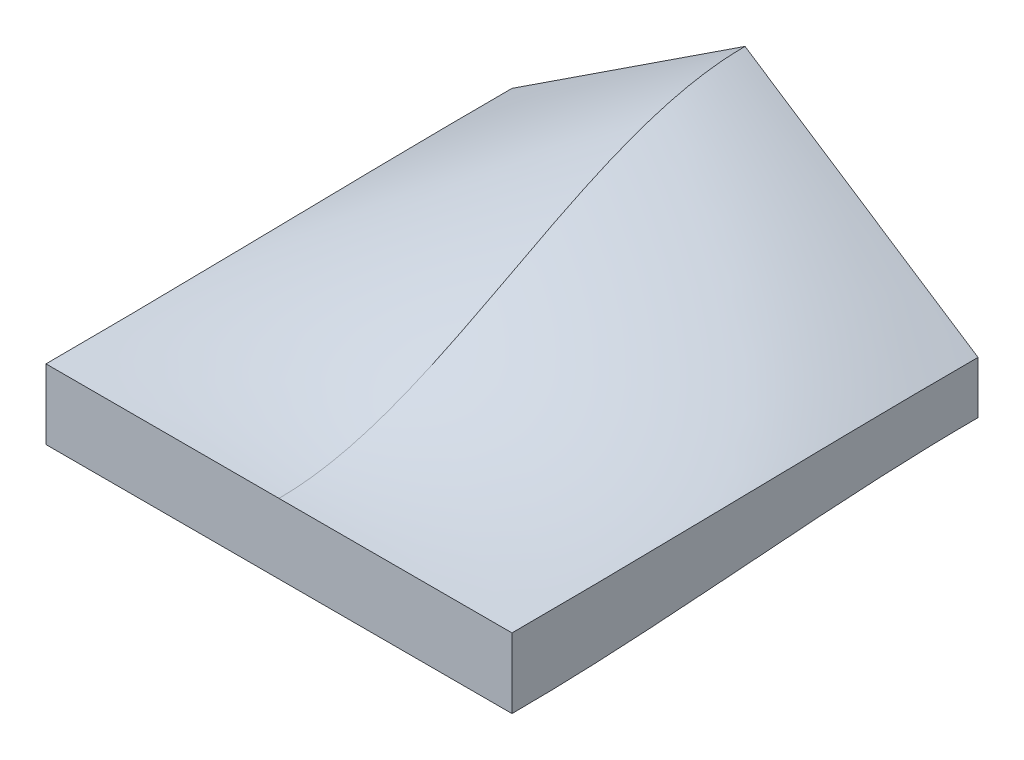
ISO-10303-21;
HEADER;
FILE_DESCRIPTION(('STEP AP214'),'2;1');
FILE_NAME('part.step','',(''),(''),'','','');
FILE_SCHEMA(('AUTOMOTIVE_DESIGN { 1 0 10303 214 1 1 1 1 }'));
ENDSEC;
DATA;
#1=APPLICATION_CONTEXT('core data for automotive mechanical design processes');
#2=APPLICATION_PROTOCOL_DEFINITION('international standard','automotive_design',2000,#1);
#3=PRODUCT_CONTEXT('',#1,'mechanical');
#4=PRODUCT('Part','Part','',(#3));
#5=PRODUCT_RELATED_PRODUCT_CATEGORY('part','',(#4));
#6=PRODUCT_DEFINITION_FORMATION('','',#4);
#7=PRODUCT_DEFINITION_CONTEXT('part definition',#1,'design');
#8=PRODUCT_DEFINITION('design','',#6,#7);
#9=PRODUCT_DEFINITION_SHAPE('','',#8);
#10=(LENGTH_UNIT() NAMED_UNIT(*) SI_UNIT(.MILLI.,.METRE.));
#11=(NAMED_UNIT(*) PLANE_ANGLE_UNIT() SI_UNIT($,.RADIAN.));
#12=(NAMED_UNIT(*) SI_UNIT($,.STERADIAN.) SOLID_ANGLE_UNIT());
#13=UNCERTAINTY_MEASURE_WITH_UNIT(LENGTH_MEASURE(1.E-05),#10,'distance_accuracy_value','');
#14=(GEOMETRIC_REPRESENTATION_CONTEXT(3) GLOBAL_UNCERTAINTY_ASSIGNED_CONTEXT((#13)) GLOBAL_UNIT_ASSIGNED_CONTEXT((#10,
#11,#12)) REPRESENTATION_CONTEXT('',''));
#15=CARTESIAN_POINT('',(0.,0.,0.));
#16=DIRECTION('',(0.,0.,1.));
#17=DIRECTION('',(1.,0.,0.));
#18=AXIS2_PLACEMENT_3D('',#15,#16,#17);
#19=CARTESIAN_POINT('',(0.,0.,-50.));
#20=DIRECTION('',(0.,0.,1.));
#21=DIRECTION('',(1.,0.,0.));
#22=AXIS2_PLACEMENT_3D('',#19,#20,#21);
#23=PLANE('',#22);
#24=DIRECTION('',(0.,-1.,0.));
#25=VECTOR('',#24,1.);
#26=CARTESIAN_POINT('',(-25.,0.6,-50.));
#27=LINE('',#26,#25);
#28=CARTESIAN_POINT('',(-25.,0.6,-50.));
#29=VERTEX_POINT('',#28);
#30=CARTESIAN_POINT('',(-25.,-5.,-50.));
#31=VERTEX_POINT('',#30);
#32=EDGE_CURVE('E177',#29,#31,#27,.T.);
#33=ORIENTED_EDGE('',*,*,#32,.F.);
#34=DIRECTION('',(-0.836143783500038,-0.548510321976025,0.));
#35=VECTOR('',#34,1.);
#36=CARTESIAN_POINT('',(-25.,0.6,-50.));
#37=LINE('',#36,#35);
#38=CARTESIAN_POINT('',(0.,17.,-50.));
#39=VERTEX_POINT('',#38);
#40=EDGE_CURVE('E12',#39,#29,#37,.T.);
#41=ORIENTED_EDGE('',*,*,#40,.F.);
#42=DIRECTION('',(-0.836143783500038,0.548510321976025,0.));
#43=VECTOR('',#42,1.);
#44=CARTESIAN_POINT('',(0.,17.,-50.));
#45=LINE('',#44,#43);
#46=CARTESIAN_POINT('',(25.,0.6,-50.));
#47=VERTEX_POINT('',#46);
#48=EDGE_CURVE('E102',#47,#39,#45,.T.);
#49=ORIENTED_EDGE('',*,*,#48,.F.);
#50=DIRECTION('',(0.,1.,0.));
#51=VECTOR('',#50,1.);
#52=CARTESIAN_POINT('',(25.,0.6,-50.));
#53=LINE('',#52,#51);
#54=CARTESIAN_POINT('',(25.,-5.,-50.));
#55=VERTEX_POINT('',#54);
#56=EDGE_CURVE('E116',#55,#47,#53,.T.);
#57=ORIENTED_EDGE('',*,*,#56,.F.);
#58=DIRECTION('',(1.,0.,0.));
#59=VECTOR('',#58,1.);
#60=CARTESIAN_POINT('',(-25.,-5.,-50.));
#61=LINE('',#60,#59);
#62=EDGE_CURVE('E110',#31,#55,#61,.T.);
#63=ORIENTED_EDGE('',*,*,#62,.F.);
#64=EDGE_LOOP('',(#33,#41,#49,#57,#63));
#65=FACE_BOUND('',#64,.T.);
#66=ADVANCED_FACE('F92',(#65),#23,.F.);
#67=CARTESIAN_POINT('',(0.,0.,0.));
#68=DIRECTION('',(0.,0.,1.));
#69=DIRECTION('',(1.,0.,0.));
#70=AXIS2_PLACEMENT_3D('',#67,#68,#69);
#71=PLANE('',#70);
#72=DIRECTION('',(0.,-1.,0.));
#73=VECTOR('',#72,1.);
#74=CARTESIAN_POINT('',(-25.,0.,0.));
#75=LINE('',#74,#73);
#76=CARTESIAN_POINT('',(-25.,0.,0.));
#77=VERTEX_POINT('',#76);
#78=CARTESIAN_POINT('',(-25.,-7.5,0.));
#79=VERTEX_POINT('',#78);
#80=EDGE_CURVE('E149',#77,#79,#75,.T.);
#81=ORIENTED_EDGE('',*,*,#80,.T.);
#82=DIRECTION('',(1.,0.,0.));
#83=VECTOR('',#82,1.);
#84=CARTESIAN_POINT('',(-25.,-7.5,0.));
#85=LINE('',#84,#83);
#86=CARTESIAN_POINT('',(25.,-7.5,0.));
#87=VERTEX_POINT('',#86);
#88=EDGE_CURVE('E169',#79,#87,#85,.T.);
#89=ORIENTED_EDGE('',*,*,#88,.T.);
#90=DIRECTION('',(0.,1.,0.));
#91=VECTOR('',#90,1.);
#92=CARTESIAN_POINT('',(25.,0.,0.));
#93=LINE('',#92,#91);
#94=CARTESIAN_POINT('',(25.,0.,0.));
#95=VERTEX_POINT('',#94);
#96=EDGE_CURVE('E297',#87,#95,#93,.T.);
#97=ORIENTED_EDGE('',*,*,#96,.T.);
#98=DIRECTION('',(-1.,0.,0.));
#99=VECTOR('',#98,1.);
#100=CARTESIAN_POINT('',(0.,0.,0.));
#101=LINE('',#100,#99);
#102=CARTESIAN_POINT('',(0.,0.,0.));
#103=VERTEX_POINT('',#102);
#104=EDGE_CURVE('E152',#95,#103,#101,.T.);
#105=ORIENTED_EDGE('',*,*,#104,.T.);
#106=DIRECTION('',(-1.,0.,0.));
#107=VECTOR('',#106,1.);
#108=CARTESIAN_POINT('',(-25.,0.,0.));
#109=LINE('',#108,#107);
#110=EDGE_CURVE('E144',#103,#77,#109,.T.);
#111=ORIENTED_EDGE('',*,*,#110,.T.);
#112=EDGE_LOOP('',(#81,#89,#97,#105,#111));
#113=FACE_BOUND('',#112,.T.);
#114=ADVANCED_FACE('F147',(#113),#71,.T.);
#115=CARTESIAN_POINT('',(25.,0.,0.));
#116=DIRECTION('',(1.,0.,0.));
#117=DIRECTION('',(0.,-1.,0.));
#118=AXIS2_PLACEMENT_3D('',#115,#116,#117);
#119=PLANE('',#118);
#120=ORIENTED_EDGE('',*,*,#96,.F.);
#121=CARTESIAN_POINT('',(25.,-7.5,0.));
#122=CARTESIAN_POINT('',(25.,-7.5,-16.6874869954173));
#123=CARTESIAN_POINT('',(25.,-5.,-33.3125130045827));
#124=CARTESIAN_POINT('',(25.,-5.,-50.));
#125=B_SPLINE_CURVE_WITH_KNOTS('',3,(#121,#122,#123,#124),.UNSPECIFIED.,.F.,.F.,(4,4),(0.,1.),.UNSPECIFIED.);
#126=EDGE_CURVE('E179',#87,#55,#125,.T.);
#127=ORIENTED_EDGE('',*,*,#126,.T.);
#128=ORIENTED_EDGE('',*,*,#56,.T.);
#129=CARTESIAN_POINT('',(25.,0.,0.));
#130=CARTESIAN_POINT('',(25.,0.,-16.6678666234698));
#131=CARTESIAN_POINT('',(25.,0.6,-33.3321333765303));
#132=CARTESIAN_POINT('',(25.,0.6,-50.));
#133=B_SPLINE_CURVE_WITH_KNOTS('',3,(#129,#130,#131,#132),.UNSPECIFIED.,.F.,.F.,(4,4),(0.,1.),.UNSPECIFIED.);
#134=EDGE_CURVE('E158',#47,#95,#133,.F.);
#135=ORIENTED_EDGE('',*,*,#134,.T.);
#136=EDGE_LOOP('',(#120,#127,#128,#135));
#137=FACE_BOUND('',#136,.T.);
#138=ADVANCED_FACE('F251',(#137),#119,.T.);
#139=CARTESIAN_POINT('',(25.,-7.5,0.));
#140=CARTESIAN_POINT('',(25.,-7.5,-16.6874869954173));
#141=CARTESIAN_POINT('',(25.,-5.,-33.3125130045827));
#142=CARTESIAN_POINT('',(25.,-5.,-50.));
#143=CARTESIAN_POINT('',(8.33333333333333,-7.5,0.));
#144=CARTESIAN_POINT('',(8.33333333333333,-7.5,-16.6874869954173));
#145=CARTESIAN_POINT('',(8.33333333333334,-5.,-33.3125130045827));
#146=CARTESIAN_POINT('',(8.33333333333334,-5.,-50.));
#147=CARTESIAN_POINT('',(-8.33333333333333,-7.5,0.));
#148=CARTESIAN_POINT('',(-8.33333333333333,-7.5,-16.6874869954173));
#149=CARTESIAN_POINT('',(-8.33333333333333,-5.,-33.3125130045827));
#150=CARTESIAN_POINT('',(-8.33333333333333,-5.,-50.));
#151=CARTESIAN_POINT('',(-25.,-7.5,0.));
#152=CARTESIAN_POINT('',(-25.,-7.5,-16.6874869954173));
#153=CARTESIAN_POINT('',(-25.,-5.,-33.3125130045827));
#154=CARTESIAN_POINT('',(-25.,-5.,-50.));
#155=B_SPLINE_SURFACE_WITH_KNOTS('',3,3,((#139,#140,#141,#142),(#143,#144,#145,#146),(#147,#148,
#149,#150),(#151,#152,#153,#154)),.UNSPECIFIED.,.F.,.F.,.F.,(4,4),(4,4),(0.,1.),(0.,1.),.UNSPECIFIED.);
#156=CARTESIAN_POINT('',(-25.,-7.5,0.));
#157=CARTESIAN_POINT('',(-25.,-7.5,-16.6874869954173));
#158=CARTESIAN_POINT('',(-25.,-5.,-33.3125130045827));
#159=CARTESIAN_POINT('',(-25.,-5.,-50.));
#160=B_SPLINE_CURVE_WITH_KNOTS('',3,(#156,#157,#158,#159),.UNSPECIFIED.,.F.,.F.,(4,4),(0.,1.),.UNSPECIFIED.);
#161=EDGE_CURVE('E168',#79,#31,#160,.T.);
#162=ORIENTED_EDGE('',*,*,#88,.F.);
#163=ORIENTED_EDGE('',*,*,#161,.T.);
#164=ORIENTED_EDGE('',*,*,#62,.T.);
#165=ORIENTED_EDGE('',*,*,#126,.F.);
#166=EDGE_LOOP('',(#162,#163,#164,#165));
#167=FACE_BOUND('',#166,.T.);
#168=ADVANCED_FACE('F220',(#167),#155,.T.);
#169=CARTESIAN_POINT('',(0.,0.,0.));
#170=CARTESIAN_POINT('',(0.,0.,-17.6036612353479));
#171=CARTESIAN_POINT('',(0.,17.,-32.3963387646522));
#172=CARTESIAN_POINT('',(0.,17.,-50.));
#173=CARTESIAN_POINT('',(8.33333333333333,0.,0.));
#174=CARTESIAN_POINT('',(8.33333333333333,0.,-17.2917296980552));
#175=CARTESIAN_POINT('',(8.33333333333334,11.5333333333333,-32.7082703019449));
#176=CARTESIAN_POINT('',(8.33333333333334,11.5333333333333,-50.));
#177=CARTESIAN_POINT('',(16.6666666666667,0.,0.));
#178=CARTESIAN_POINT('',(16.6666666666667,0.,-16.9797981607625));
#179=CARTESIAN_POINT('',(16.6666666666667,6.06666666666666,-33.0202018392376));
#180=CARTESIAN_POINT('',(16.6666666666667,6.06666666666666,-50.));
#181=CARTESIAN_POINT('',(25.,0.,0.));
#182=CARTESIAN_POINT('',(25.,0.,-16.6678666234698));
#183=CARTESIAN_POINT('',(25.,0.599999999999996,-33.3321333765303));
#184=CARTESIAN_POINT('',(25.,0.599999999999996,-50.));
#185=B_SPLINE_SURFACE_WITH_KNOTS('',3,3,((#169,#170,#171,#172),(#173,#174,#175,#176),(#177,#178,
#179,#180),(#181,#182,#183,#184)),.UNSPECIFIED.,.F.,.F.,.F.,(4,4),(4,4),(0.,1.),(0.,1.),.UNSPECIFIED.);
#186=CARTESIAN_POINT('',(0.,0.,0.));
#187=CARTESIAN_POINT('',(0.,0.,-17.6036612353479));
#188=CARTESIAN_POINT('',(0.,17.,-32.3963387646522));
#189=CARTESIAN_POINT('',(0.,17.,-50.));
#190=B_SPLINE_CURVE_WITH_KNOTS('',3,(#186,#187,#188,#189),.UNSPECIFIED.,.F.,.F.,(4,4),(0.,1.),.UNSPECIFIED.);
#191=EDGE_CURVE('E175',#103,#39,#190,.T.);
#192=ORIENTED_EDGE('',*,*,#104,.F.);
#193=ORIENTED_EDGE('',*,*,#134,.F.);
#194=ORIENTED_EDGE('',*,*,#48,.T.);
#195=ORIENTED_EDGE('',*,*,#191,.F.);
#196=EDGE_LOOP('',(#192,#193,#194,#195));
#197=FACE_BOUND('',#196,.T.);
#198=ADVANCED_FACE('F208',(#197),#185,.T.);
#199=CARTESIAN_POINT('',(-25.,-7.5,0.));
#200=DIRECTION('',(-1.,0.,0.));
#201=DIRECTION('',(0.,1.,0.));
#202=AXIS2_PLACEMENT_3D('',#199,#200,#201);
#203=PLANE('',#202);
#204=ORIENTED_EDGE('',*,*,#80,.F.);
#205=CARTESIAN_POINT('',(-25.,0.,0.));
#206=CARTESIAN_POINT('',(-25.,0.,-16.6678666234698));
#207=CARTESIAN_POINT('',(-25.,0.6,-33.3321333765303));
#208=CARTESIAN_POINT('',(-25.,0.6,-50.));
#209=B_SPLINE_CURVE_WITH_KNOTS('',3,(#205,#206,#207,#208),.UNSPECIFIED.,.F.,.F.,(4,4),(0.,1.),.UNSPECIFIED.);
#210=EDGE_CURVE('E166',#77,#29,#209,.T.);
#211=ORIENTED_EDGE('',*,*,#210,.T.);
#212=ORIENTED_EDGE('',*,*,#32,.T.);
#213=ORIENTED_EDGE('',*,*,#161,.F.);
#214=EDGE_LOOP('',(#204,#211,#212,#213));
#215=FACE_BOUND('',#214,.T.);
#216=ADVANCED_FACE('F165',(#215),#203,.T.);
#217=CARTESIAN_POINT('',(-25.,0.,0.));
#218=CARTESIAN_POINT('',(-25.,0.,-16.6678666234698));
#219=CARTESIAN_POINT('',(-25.,0.6,-33.3321333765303));
#220=CARTESIAN_POINT('',(-25.,0.6,-50.));
#221=CARTESIAN_POINT('',(-16.6666666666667,0.,0.));
#222=CARTESIAN_POINT('',(-16.6666666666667,0.,-16.9797981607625));
#223=CARTESIAN_POINT('',(-16.6666666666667,6.06666666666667,-33.0202018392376));
#224=CARTESIAN_POINT('',(-16.6666666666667,6.06666666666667,-50.));
#225=CARTESIAN_POINT('',(-8.33333333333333,0.,0.));
#226=CARTESIAN_POINT('',(-8.33333333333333,0.,-17.2917296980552));
#227=CARTESIAN_POINT('',(-8.33333333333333,11.5333333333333,-32.7082703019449));
#228=CARTESIAN_POINT('',(-8.33333333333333,11.5333333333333,-50.));
#229=CARTESIAN_POINT('',(0.,0.,0.));
#230=CARTESIAN_POINT('',(0.,0.,-17.6036612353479));
#231=CARTESIAN_POINT('',(0.,17.,-32.3963387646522));
#232=CARTESIAN_POINT('',(0.,17.,-50.));
#233=B_SPLINE_SURFACE_WITH_KNOTS('',3,3,((#217,#218,#219,#220),(#221,#222,#223,#224),(#225,#226,
#227,#228),(#229,#230,#231,#232)),.UNSPECIFIED.,.F.,.F.,.F.,(4,4),(4,4),(0.,1.),(0.,1.),.UNSPECIFIED.);
#234=ORIENTED_EDGE('',*,*,#110,.F.);
#235=ORIENTED_EDGE('',*,*,#191,.T.);
#236=ORIENTED_EDGE('',*,*,#40,.T.);
#237=ORIENTED_EDGE('',*,*,#210,.F.);
#238=EDGE_LOOP('',(#234,#235,#236,#237));
#239=FACE_BOUND('',#238,.T.);
#240=ADVANCED_FACE('F173',(#239),#233,.T.);
#241=CLOSED_SHELL('',(#66,#114,#138,#168,#198,#216,#240));
#242=MANIFOLD_SOLID_BREP('B2',#241);
#243=ADVANCED_BREP_SHAPE_REPRESENTATION('',(#18,#242),#14);
#244=SHAPE_DEFINITION_REPRESENTATION(#9,#243);
ENDSEC;
END-ISO-10303-21;
